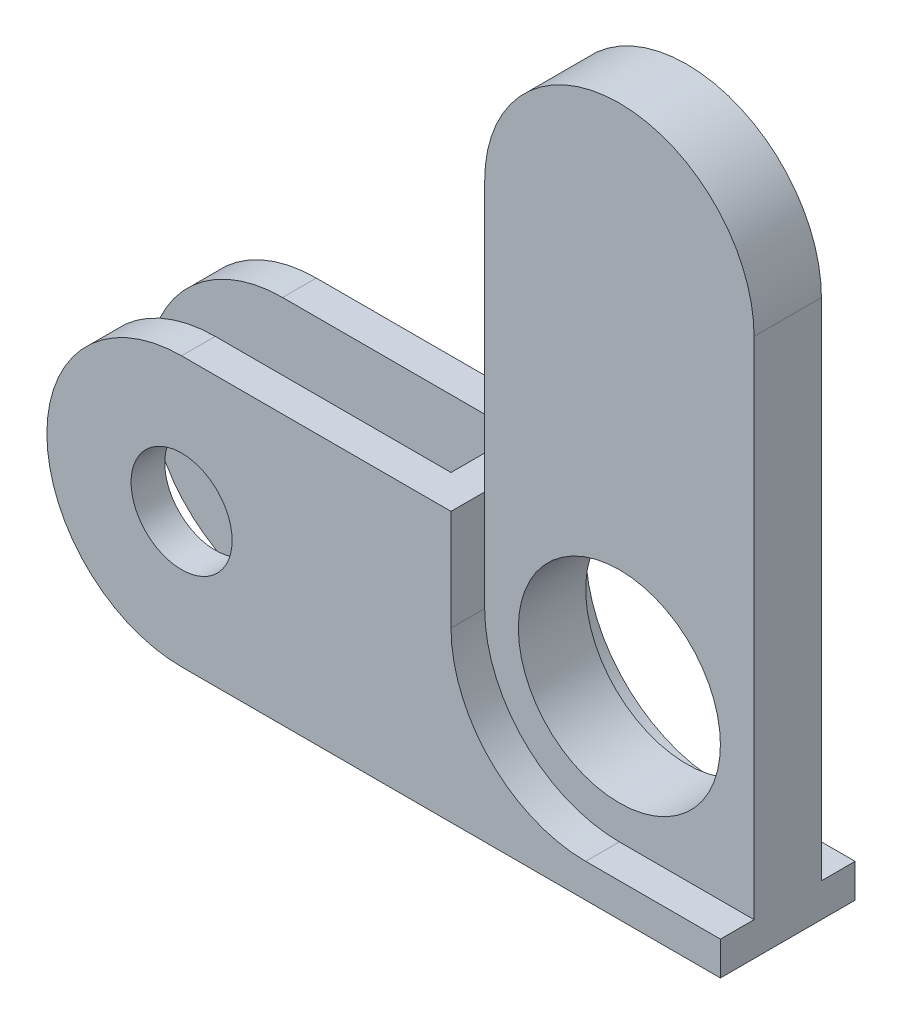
ISO-10303-21;
HEADER;
FILE_DESCRIPTION(('STEP AP214'),'2;1');
FILE_NAME('part.step','',(''),(''),'','','');
FILE_SCHEMA(('AUTOMOTIVE_DESIGN { 1 0 10303 214 1 1 1 1 }'));
ENDSEC;
DATA;
#1=APPLICATION_CONTEXT('core data for automotive mechanical design processes');
#2=APPLICATION_PROTOCOL_DEFINITION('international standard','automotive_design',2000,#1);
#3=PRODUCT_CONTEXT('',#1,'mechanical');
#4=PRODUCT('Part','Part','',(#3));
#5=PRODUCT_RELATED_PRODUCT_CATEGORY('part','',(#4));
#6=PRODUCT_DEFINITION_FORMATION('','',#4);
#7=PRODUCT_DEFINITION_CONTEXT('part definition',#1,'design');
#8=PRODUCT_DEFINITION('design','',#6,#7);
#9=PRODUCT_DEFINITION_SHAPE('','',#8);
#10=(LENGTH_UNIT() NAMED_UNIT(*) SI_UNIT(.MILLI.,.METRE.));
#11=(NAMED_UNIT(*) PLANE_ANGLE_UNIT() SI_UNIT($,.RADIAN.));
#12=(NAMED_UNIT(*) SI_UNIT($,.STERADIAN.) SOLID_ANGLE_UNIT());
#13=UNCERTAINTY_MEASURE_WITH_UNIT(LENGTH_MEASURE(1.E-05),#10,'distance_accuracy_value','');
#14=(GEOMETRIC_REPRESENTATION_CONTEXT(3) GLOBAL_UNCERTAINTY_ASSIGNED_CONTEXT((#13)) GLOBAL_UNIT_ASSIGNED_CONTEXT((#10,
#11,#12)) REPRESENTATION_CONTEXT('',''));
#15=CARTESIAN_POINT('',(0.,0.,0.));
#16=DIRECTION('',(0.,0.,1.));
#17=DIRECTION('',(1.,0.,0.));
#18=AXIS2_PLACEMENT_3D('',#15,#16,#17);
#19=CARTESIAN_POINT('',(-80.,20.,-10.));
#20=DIRECTION('',(0.,0.,1.));
#21=DIRECTION('',(1.,0.,0.));
#22=AXIS2_PLACEMENT_3D('',#19,#20,#21);
#23=CYLINDRICAL_SURFACE('',#22,20.);
#24=CARTESIAN_POINT('',(-80.,20.,-4.99999999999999));
#25=DIRECTION('',(0.,0.,-1.));
#26=DIRECTION('',(-1.,0.,0.));
#27=AXIS2_PLACEMENT_3D('',#24,#25,#26);
#28=CIRCLE('',#27,20.);
#29=CARTESIAN_POINT('',(-80.,40.,-4.99999999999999));
#30=VERTEX_POINT('',#29);
#31=CARTESIAN_POINT('',(-80.,0.,-4.99999999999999));
#32=VERTEX_POINT('',#31);
#33=EDGE_CURVE('E189',#30,#32,#28,.F.);
#34=ORIENTED_EDGE('',*,*,#33,.F.);
#35=DIRECTION('',(0.,0.,1.));
#36=VECTOR('',#35,1.);
#37=CARTESIAN_POINT('',(-80.,40.,-10.));
#38=LINE('',#37,#36);
#39=CARTESIAN_POINT('',(-80.,40.,-10.));
#40=VERTEX_POINT('',#39);
#41=EDGE_CURVE('E257',#40,#30,#38,.T.);
#42=ORIENTED_EDGE('',*,*,#41,.F.);
#43=CARTESIAN_POINT('',(-80.,20.,-10.));
#44=DIRECTION('',(0.,0.,-1.));
#45=DIRECTION('',(-1.,0.,0.));
#46=AXIS2_PLACEMENT_3D('',#43,#44,#45);
#47=CIRCLE('',#46,20.);
#48=CARTESIAN_POINT('',(-80.,0.,-10.));
#49=VERTEX_POINT('',#48);
#50=EDGE_CURVE('E262',#49,#40,#47,.T.);
#51=ORIENTED_EDGE('',*,*,#50,.F.);
#52=DIRECTION('',(0.,0.,1.));
#53=VECTOR('',#52,1.);
#54=CARTESIAN_POINT('',(-80.,0.,10.));
#55=LINE('',#54,#53);
#56=EDGE_CURVE('E260',#32,#49,#55,.F.);
#57=ORIENTED_EDGE('',*,*,#56,.F.);
#58=EDGE_LOOP('',(#34,#42,#51,#57));
#59=FACE_BOUND('',#58,.T.);
#60=ADVANCED_FACE('F31',(#59),#23,.T.);
#61=CARTESIAN_POINT('',(-80.,20.,-10.));
#62=DIRECTION('',(0.,0.,1.));
#63=DIRECTION('',(1.,0.,0.));
#64=AXIS2_PLACEMENT_3D('',#61,#62,#63);
#65=CYLINDRICAL_SURFACE('',#64,7.5);
#66=CARTESIAN_POINT('',(-80.,20.,-4.99999999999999));
#67=DIRECTION('',(0.,0.,-1.));
#68=DIRECTION('',(-1.,0.,0.));
#69=AXIS2_PLACEMENT_3D('',#66,#67,#68);
#70=CIRCLE('',#69,7.5);
#71=CARTESIAN_POINT('',(-87.5,20.,-4.99999999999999));
#72=VERTEX_POINT('',#71);
#73=EDGE_CURVE('E186',#72,#72,#70,.F.);
#74=ORIENTED_EDGE('',*,*,#73,.T.);
#75=EDGE_LOOP('',(#74));
#76=FACE_BOUND('',#75,.T.);
#77=CARTESIAN_POINT('',(-80.,20.,-10.));
#78=DIRECTION('',(0.,0.,1.));
#79=DIRECTION('',(1.,0.,0.));
#80=AXIS2_PLACEMENT_3D('',#77,#78,#79);
#81=CIRCLE('',#80,7.5);
#82=CARTESIAN_POINT('',(-72.5,20.,-10.));
#83=VERTEX_POINT('',#82);
#84=EDGE_CURVE('E238',#83,#83,#81,.T.);
#85=ORIENTED_EDGE('',*,*,#84,.F.);
#86=EDGE_LOOP('',(#85));
#87=FACE_BOUND('',#86,.T.);
#88=ADVANCED_FACE('F362',(#76,#87),#65,.F.);
#89=CARTESIAN_POINT('',(-20.,80.,-5.));
#90=DIRECTION('',(0.,0.,-1.));
#91=DIRECTION('',(-1.,0.,0.));
#92=AXIS2_PLACEMENT_3D('',#89,#90,#91);
#93=CYLINDRICAL_SURFACE('',#92,20.);
#94=DIRECTION('',(0.,0.,-1.));
#95=VECTOR('',#94,1.);
#96=CARTESIAN_POINT('',(0.,80.,10.));
#97=LINE('',#96,#95);
#98=CARTESIAN_POINT('',(0.,80.,-5.));
#99=VERTEX_POINT('',#98);
#100=CARTESIAN_POINT('',(0.,80.,5.));
#101=VERTEX_POINT('',#100);
#102=EDGE_CURVE('E266',#99,#101,#97,.F.);
#103=ORIENTED_EDGE('',*,*,#102,.F.);
#104=CARTESIAN_POINT('',(-20.,80.,-5.));
#105=DIRECTION('',(0.,0.,1.));
#106=DIRECTION('',(1.,0.,0.));
#107=AXIS2_PLACEMENT_3D('',#104,#105,#106);
#108=CIRCLE('',#107,20.);
#109=CARTESIAN_POINT('',(-40.,80.,-5.));
#110=VERTEX_POINT('',#109);
#111=EDGE_CURVE('E272',#110,#99,#108,.F.);
#112=ORIENTED_EDGE('',*,*,#111,.F.);
#113=DIRECTION('',(0.,0.,-1.));
#114=VECTOR('',#113,1.);
#115=CARTESIAN_POINT('',(-40.,80.,-10.));
#116=LINE('',#115,#114);
#117=CARTESIAN_POINT('',(-40.,80.,5.));
#118=VERTEX_POINT('',#117);
#119=EDGE_CURVE('E269',#118,#110,#116,.T.);
#120=ORIENTED_EDGE('',*,*,#119,.F.);
#121=CARTESIAN_POINT('',(-20.,80.,5.));
#122=DIRECTION('',(0.,0.,-1.));
#123=DIRECTION('',(-1.,0.,0.));
#124=AXIS2_PLACEMENT_3D('',#121,#122,#123);
#125=CIRCLE('',#124,20.);
#126=EDGE_CURVE('E274',#101,#118,#125,.F.);
#127=ORIENTED_EDGE('',*,*,#126,.F.);
#128=EDGE_LOOP('',(#103,#112,#120,#127));
#129=FACE_BOUND('',#128,.T.);
#130=ADVANCED_FACE('F317',(#129),#93,.T.);
#131=CARTESIAN_POINT('',(-80.,20.,5.00000000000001));
#132=DIRECTION('',(0.,0.,1.));
#133=DIRECTION('',(1.,0.,0.));
#134=AXIS2_PLACEMENT_3D('',#131,#132,#133);
#135=CIRCLE('',#134,20.);
#136=CARTESIAN_POINT('',(-80.,0.,5.00000000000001));
#137=VERTEX_POINT('',#136);
#138=CARTESIAN_POINT('',(-80.,40.,5.00000000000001));
#139=VERTEX_POINT('',#138);
#140=EDGE_CURVE('E46',#137,#139,#135,.F.);
#141=ORIENTED_EDGE('',*,*,#140,.F.);
#142=CARTESIAN_POINT('',(-80.,0.,10.));
#143=VERTEX_POINT('',#142);
#144=EDGE_CURVE('E172',#143,#137,#55,.F.);
#145=ORIENTED_EDGE('',*,*,#144,.F.);
#146=CARTESIAN_POINT('',(-80.,20.,10.));
#147=DIRECTION('',(0.,0.,-1.));
#148=DIRECTION('',(-1.,0.,0.));
#149=AXIS2_PLACEMENT_3D('',#146,#147,#148);
#150=CIRCLE('',#149,20.);
#151=CARTESIAN_POINT('',(-80.,40.,10.));
#152=VERTEX_POINT('',#151);
#153=EDGE_CURVE('E264',#152,#143,#150,.F.);
#154=ORIENTED_EDGE('',*,*,#153,.F.);
#155=EDGE_CURVE('E256',#139,#152,#38,.T.);
#156=ORIENTED_EDGE('',*,*,#155,.F.);
#157=EDGE_LOOP('',(#141,#145,#154,#156));
#158=FACE_BOUND('',#157,.T.);
#159=ADVANCED_FACE('F329',(#158),#23,.T.);
#160=CARTESIAN_POINT('',(0.,0.,10.));
#161=DIRECTION('',(-1.,0.,0.));
#162=DIRECTION('',(0.,0.,1.));
#163=AXIS2_PLACEMENT_3D('',#160,#161,#162);
#164=PLANE('',#163);
#165=DIRECTION('',(0.,1.,0.));
#166=VECTOR('',#165,1.);
#167=CARTESIAN_POINT('',(0.,100.,-5.));
#168=LINE('',#167,#166);
#169=CARTESIAN_POINT('',(0.,5.,-5.));
#170=VERTEX_POINT('',#169);
#171=EDGE_CURVE('E192',#170,#99,#168,.T.);
#172=ORIENTED_EDGE('',*,*,#171,.T.);
#173=ORIENTED_EDGE('',*,*,#102,.T.);
#174=DIRECTION('',(0.,1.,0.));
#175=VECTOR('',#174,1.);
#176=CARTESIAN_POINT('',(0.,100.,5.));
#177=LINE('',#176,#175);
#178=CARTESIAN_POINT('',(0.,5.,5.));
#179=VERTEX_POINT('',#178);
#180=EDGE_CURVE('E211',#179,#101,#177,.T.);
#181=ORIENTED_EDGE('',*,*,#180,.F.);
#182=DIRECTION('',(0.,0.,1.));
#183=VECTOR('',#182,1.);
#184=CARTESIAN_POINT('',(0.,5.,5.));
#185=LINE('',#184,#183);
#186=CARTESIAN_POINT('',(0.,5.,10.));
#187=VERTEX_POINT('',#186);
#188=EDGE_CURVE('E220',#179,#187,#185,.T.);
#189=ORIENTED_EDGE('',*,*,#188,.T.);
#190=DIRECTION('',(0.,1.,0.));
#191=VECTOR('',#190,1.);
#192=CARTESIAN_POINT('',(0.,0.,10.));
#193=LINE('',#192,#191);
#194=CARTESIAN_POINT('',(0.,0.,10.));
#195=VERTEX_POINT('',#194);
#196=EDGE_CURVE('E246',#195,#187,#193,.T.);
#197=ORIENTED_EDGE('',*,*,#196,.F.);
#198=DIRECTION('',(0.,0.,-1.));
#199=VECTOR('',#198,1.);
#200=CARTESIAN_POINT('',(0.,0.,10.));
#201=LINE('',#200,#199);
#202=CARTESIAN_POINT('',(0.,0.,-10.));
#203=VERTEX_POINT('',#202);
#204=EDGE_CURVE('E250',#195,#203,#201,.T.);
#205=ORIENTED_EDGE('',*,*,#204,.T.);
#206=DIRECTION('',(0.,1.,0.));
#207=VECTOR('',#206,1.);
#208=CARTESIAN_POINT('',(0.,0.,-10.));
#209=LINE('',#208,#207);
#210=CARTESIAN_POINT('',(0.,5.,-10.));
#211=VERTEX_POINT('',#210);
#212=EDGE_CURVE('E247',#203,#211,#209,.T.);
#213=ORIENTED_EDGE('',*,*,#212,.T.);
#214=DIRECTION('',(0.,0.,-1.));
#215=VECTOR('',#214,1.);
#216=CARTESIAN_POINT('',(0.,5.,-5.));
#217=LINE('',#216,#215);
#218=EDGE_CURVE('E201',#170,#211,#217,.T.);
#219=ORIENTED_EDGE('',*,*,#218,.F.);
#220=EDGE_LOOP('',(#172,#173,#181,#189,#197,#205,#213,#219));
#221=FACE_BOUND('',#220,.T.);
#222=ADVANCED_FACE('F311',(#221),#164,.F.);
#223=CARTESIAN_POINT('',(-100.,100.,-10.));
#224=DIRECTION('',(0.,0.,-1.));
#225=DIRECTION('',(-1.,0.,0.));
#226=AXIS2_PLACEMENT_3D('',#223,#224,#225);
#227=PLANE('',#226);
#228=ORIENTED_EDGE('',*,*,#84,.T.);
#229=EDGE_LOOP('',(#228));
#230=FACE_BOUND('',#229,.T.);
#231=DIRECTION('',(1.,0.,0.));
#232=VECTOR('',#231,1.);
#233=CARTESIAN_POINT('',(-100.,0.,-10.));
#234=LINE('',#233,#232);
#235=EDGE_CURVE('E241',#49,#203,#234,.T.);
#236=ORIENTED_EDGE('',*,*,#235,.F.);
#237=ORIENTED_EDGE('',*,*,#50,.T.);
#238=DIRECTION('',(1.,0.,0.));
#239=VECTOR('',#238,1.);
#240=CARTESIAN_POINT('',(-100.,40.,-10.));
#241=LINE('',#240,#239);
#242=CARTESIAN_POINT('',(-40.,40.,-10.));
#243=VERTEX_POINT('',#242);
#244=EDGE_CURVE('E229',#40,#243,#241,.T.);
#245=ORIENTED_EDGE('',*,*,#244,.T.);
#246=DIRECTION('',(0.,-1.,0.));
#247=VECTOR('',#246,1.);
#248=CARTESIAN_POINT('',(-40.,100.,-10.));
#249=LINE('',#248,#247);
#250=CARTESIAN_POINT('',(-40.,25.,-10.));
#251=VERTEX_POINT('',#250);
#252=EDGE_CURVE('E196',#243,#251,#249,.T.);
#253=ORIENTED_EDGE('',*,*,#252,.T.);
#254=CARTESIAN_POINT('',(-20.,25.,-10.));
#255=DIRECTION('',(0.,0.,-1.));
#256=DIRECTION('',(-1.,0.,0.));
#257=AXIS2_PLACEMENT_3D('',#254,#255,#256);
#258=CIRCLE('',#257,20.);
#259=CARTESIAN_POINT('',(-20.,5.,-10.));
#260=VERTEX_POINT('',#259);
#261=EDGE_CURVE('E289',#251,#260,#258,.F.);
#262=ORIENTED_EDGE('',*,*,#261,.T.);
#263=DIRECTION('',(1.,0.,0.));
#264=VECTOR('',#263,1.);
#265=CARTESIAN_POINT('',(0.,5.,-10.));
#266=LINE('',#265,#264);
#267=EDGE_CURVE('E191',#260,#211,#266,.T.);
#268=ORIENTED_EDGE('',*,*,#267,.T.);
#269=ORIENTED_EDGE('',*,*,#212,.F.);
#270=EDGE_LOOP('',(#236,#237,#245,#253,#262,#268,#269));
#271=FACE_BOUND('',#270,.T.);
#272=ADVANCED_FACE('F334',(#230,#271),#227,.T.);
#273=CARTESIAN_POINT('',(-100.,0.,10.));
#274=DIRECTION('',(0.,1.,0.));
#275=DIRECTION('',(0.,0.,1.));
#276=AXIS2_PLACEMENT_3D('',#273,#274,#275);
#277=PLANE('',#276);
#278=DIRECTION('',(0.,0.,-1.));
#279=VECTOR('',#278,1.);
#280=CARTESIAN_POINT('',(-45.,0.,-5.));
#281=LINE('',#280,#279);
#282=CARTESIAN_POINT('',(-45.,0.,5.00000000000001));
#283=VERTEX_POINT('',#282);
#284=CARTESIAN_POINT('',(-45.,0.,-5.));
#285=VERTEX_POINT('',#284);
#286=EDGE_CURVE('E162',#283,#285,#281,.T.);
#287=ORIENTED_EDGE('',*,*,#286,.T.);
#288=DIRECTION('',(-1.,0.,0.));
#289=VECTOR('',#288,1.);
#290=CARTESIAN_POINT('',(-100.,0.,-4.99999999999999));
#291=LINE('',#290,#289);
#292=EDGE_CURVE('E159',#285,#32,#291,.T.);
#293=ORIENTED_EDGE('',*,*,#292,.T.);
#294=ORIENTED_EDGE('',*,*,#56,.T.);
#295=ORIENTED_EDGE('',*,*,#235,.T.);
#296=ORIENTED_EDGE('',*,*,#204,.F.);
#297=DIRECTION('',(1.,0.,0.));
#298=VECTOR('',#297,1.);
#299=CARTESIAN_POINT('',(-100.,0.,10.));
#300=LINE('',#299,#298);
#301=EDGE_CURVE('E244',#143,#195,#300,.T.);
#302=ORIENTED_EDGE('',*,*,#301,.F.);
#303=ORIENTED_EDGE('',*,*,#144,.T.);
#304=DIRECTION('',(1.,0.,0.));
#305=VECTOR('',#304,1.);
#306=CARTESIAN_POINT('',(-100.,0.,5.00000000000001));
#307=LINE('',#306,#305);
#308=EDGE_CURVE('E154',#137,#283,#307,.T.);
#309=ORIENTED_EDGE('',*,*,#308,.T.);
#310=EDGE_LOOP('',(#287,#293,#294,#295,#296,#302,#303,#309));
#311=FACE_BOUND('',#310,.T.);
#312=ADVANCED_FACE('F169',(#311),#277,.F.);
#313=CARTESIAN_POINT('',(-100.,100.,10.));
#314=DIRECTION('',(0.,0.,-1.));
#315=DIRECTION('',(-1.,0.,0.));
#316=AXIS2_PLACEMENT_3D('',#313,#314,#315);
#317=PLANE('',#316);
#318=CARTESIAN_POINT('',(-80.,20.,10.));
#319=DIRECTION('',(0.,0.,1.));
#320=DIRECTION('',(1.,0.,0.));
#321=AXIS2_PLACEMENT_3D('',#318,#319,#320);
#322=CIRCLE('',#321,7.5);
#323=CARTESIAN_POINT('',(-72.5,20.,10.));
#324=VERTEX_POINT('',#323);
#325=EDGE_CURVE('E236',#324,#324,#322,.T.);
#326=ORIENTED_EDGE('',*,*,#325,.F.);
#327=EDGE_LOOP('',(#326));
#328=FACE_BOUND('',#327,.T.);
#329=DIRECTION('',(1.,0.,0.));
#330=VECTOR('',#329,1.);
#331=CARTESIAN_POINT('',(-100.,40.,10.));
#332=LINE('',#331,#330);
#333=CARTESIAN_POINT('',(-40.,40.,10.));
#334=VERTEX_POINT('',#333);
#335=EDGE_CURVE('E228',#152,#334,#332,.T.);
#336=ORIENTED_EDGE('',*,*,#335,.F.);
#337=ORIENTED_EDGE('',*,*,#153,.T.);
#338=ORIENTED_EDGE('',*,*,#301,.T.);
#339=ORIENTED_EDGE('',*,*,#196,.T.);
#340=DIRECTION('',(1.,0.,0.));
#341=VECTOR('',#340,1.);
#342=CARTESIAN_POINT('',(0.,5.,10.));
#343=LINE('',#342,#341);
#344=CARTESIAN_POINT('',(-20.,5.,10.));
#345=VERTEX_POINT('',#344);
#346=EDGE_CURVE('E215',#345,#187,#343,.T.);
#347=ORIENTED_EDGE('',*,*,#346,.F.);
#348=CARTESIAN_POINT('',(-20.,25.,10.));
#349=DIRECTION('',(0.,0.,-1.));
#350=DIRECTION('',(-1.,0.,0.));
#351=AXIS2_PLACEMENT_3D('',#348,#349,#350);
#352=CIRCLE('',#351,20.);
#353=CARTESIAN_POINT('',(-40.,25.,10.));
#354=VERTEX_POINT('',#353);
#355=EDGE_CURVE('E39',#345,#354,#352,.T.);
#356=ORIENTED_EDGE('',*,*,#355,.T.);
#357=DIRECTION('',(0.,-1.,0.));
#358=VECTOR('',#357,1.);
#359=CARTESIAN_POINT('',(-40.,100.,10.));
#360=LINE('',#359,#358);
#361=EDGE_CURVE('E210',#334,#354,#360,.T.);
#362=ORIENTED_EDGE('',*,*,#361,.F.);
#363=EDGE_LOOP('',(#336,#337,#338,#339,#347,#356,#362));
#364=FACE_BOUND('',#363,.T.);
#365=ADVANCED_FACE('F294',(#328,#364),#317,.F.);
#366=CARTESIAN_POINT('',(-80.,20.,5.00000000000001));
#367=DIRECTION('',(0.,0.,1.));
#368=DIRECTION('',(1.,0.,0.));
#369=AXIS2_PLACEMENT_3D('',#366,#367,#368);
#370=CIRCLE('',#369,7.5);
#371=CARTESIAN_POINT('',(-72.5,20.,5.00000000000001));
#372=VERTEX_POINT('',#371);
#373=EDGE_CURVE('E181',#372,#372,#370,.F.);
#374=ORIENTED_EDGE('',*,*,#373,.T.);
#375=EDGE_LOOP('',(#374));
#376=FACE_BOUND('',#375,.T.);
#377=ORIENTED_EDGE('',*,*,#325,.T.);
#378=EDGE_LOOP('',(#377));
#379=FACE_BOUND('',#378,.T.);
#380=ADVANCED_FACE('F370',(#376,#379),#65,.F.);
#381=CARTESIAN_POINT('',(-20.,25.,-10.));
#382=DIRECTION('',(0.,0.,1.));
#383=DIRECTION('',(1.,0.,0.));
#384=AXIS2_PLACEMENT_3D('',#381,#382,#383);
#385=CYLINDRICAL_SURFACE('',#384,15.);
#386=CARTESIAN_POINT('',(-20.,25.,-5.));
#387=DIRECTION('',(0.,0.,1.));
#388=DIRECTION('',(1.,0.,0.));
#389=AXIS2_PLACEMENT_3D('',#386,#387,#388);
#390=CIRCLE('',#389,15.);
#391=CARTESIAN_POINT('',(-5.00000000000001,25.,-5.));
#392=VERTEX_POINT('',#391);
#393=EDGE_CURVE('E207',#392,#392,#390,.F.);
#394=ORIENTED_EDGE('',*,*,#393,.T.);
#395=EDGE_LOOP('',(#394));
#396=FACE_BOUND('',#395,.T.);
#397=CARTESIAN_POINT('',(-20.,25.,5.));
#398=DIRECTION('',(0.,0.,-1.));
#399=DIRECTION('',(-1.,0.,0.));
#400=AXIS2_PLACEMENT_3D('',#397,#398,#399);
#401=CIRCLE('',#400,15.);
#402=CARTESIAN_POINT('',(-35.,25.,5.));
#403=VERTEX_POINT('',#402);
#404=EDGE_CURVE('E225',#403,#403,#401,.F.);
#405=ORIENTED_EDGE('',*,*,#404,.T.);
#406=EDGE_LOOP('',(#405));
#407=FACE_BOUND('',#406,.T.);
#408=ADVANCED_FACE('F414',(#396,#407),#385,.F.);
#409=CARTESIAN_POINT('',(-40.,100.,-10.));
#410=DIRECTION('',(1.,0.,0.));
#411=DIRECTION('',(0.,0.,-1.));
#412=AXIS2_PLACEMENT_3D('',#409,#410,#411);
#413=PLANE('',#412);
#414=DIRECTION('',(0.,-1.,0.));
#415=VECTOR('',#414,1.);
#416=CARTESIAN_POINT('',(-40.,100.,5.));
#417=LINE('',#416,#415);
#418=CARTESIAN_POINT('',(-40.,40.,5.));
#419=VERTEX_POINT('',#418);
#420=EDGE_CURVE('E216',#118,#419,#417,.T.);
#421=ORIENTED_EDGE('',*,*,#420,.F.);
#422=ORIENTED_EDGE('',*,*,#119,.T.);
#423=DIRECTION('',(0.,-1.,0.));
#424=VECTOR('',#423,1.);
#425=CARTESIAN_POINT('',(-40.,100.,-5.));
#426=LINE('',#425,#424);
#427=CARTESIAN_POINT('',(-40.,40.,-5.));
#428=VERTEX_POINT('',#427);
#429=EDGE_CURVE('E199',#110,#428,#426,.T.);
#430=ORIENTED_EDGE('',*,*,#429,.T.);
#431=DIRECTION('',(0.,0.,1.));
#432=VECTOR('',#431,1.);
#433=CARTESIAN_POINT('',(-40.,40.,-10.));
#434=LINE('',#433,#432);
#435=EDGE_CURVE('E237',#428,#419,#434,.T.);
#436=ORIENTED_EDGE('',*,*,#435,.T.);
#437=EDGE_LOOP('',(#421,#422,#430,#436));
#438=FACE_BOUND('',#437,.T.);
#439=ADVANCED_FACE('F320',(#438),#413,.F.);
#440=CARTESIAN_POINT('',(-100.,40.,-10.));
#441=DIRECTION('',(0.,-1.,0.));
#442=DIRECTION('',(0.,0.,-1.));
#443=AXIS2_PLACEMENT_3D('',#440,#441,#442);
#444=PLANE('',#443);
#445=ORIENTED_EDGE('',*,*,#41,.T.);
#446=DIRECTION('',(-1.,0.,0.));
#447=VECTOR('',#446,1.);
#448=CARTESIAN_POINT('',(-100.,40.,-4.99999999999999));
#449=LINE('',#448,#447);
#450=CARTESIAN_POINT('',(-45.,40.,-5.));
#451=VERTEX_POINT('',#450);
#452=EDGE_CURVE('E173',#451,#30,#449,.T.);
#453=ORIENTED_EDGE('',*,*,#452,.F.);
#454=DIRECTION('',(0.,0.,-1.));
#455=VECTOR('',#454,1.);
#456=CARTESIAN_POINT('',(-45.,40.,-5.));
#457=LINE('',#456,#455);
#458=CARTESIAN_POINT('',(-45.,40.,5.00000000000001));
#459=VERTEX_POINT('',#458);
#460=EDGE_CURVE('E176',#459,#451,#457,.T.);
#461=ORIENTED_EDGE('',*,*,#460,.F.);
#462=DIRECTION('',(-1.,0.,0.));
#463=VECTOR('',#462,1.);
#464=CARTESIAN_POINT('',(-100.,40.,5.00000000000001));
#465=LINE('',#464,#463);
#466=EDGE_CURVE('E11',#459,#139,#465,.T.);
#467=ORIENTED_EDGE('',*,*,#466,.T.);
#468=ORIENTED_EDGE('',*,*,#155,.T.);
#469=ORIENTED_EDGE('',*,*,#335,.T.);
#470=EDGE_CURVE('E231',#419,#334,#434,.T.);
#471=ORIENTED_EDGE('',*,*,#470,.F.);
#472=ORIENTED_EDGE('',*,*,#435,.F.);
#473=EDGE_CURVE('E233',#243,#428,#434,.T.);
#474=ORIENTED_EDGE('',*,*,#473,.F.);
#475=ORIENTED_EDGE('',*,*,#244,.F.);
#476=EDGE_LOOP('',(#445,#453,#461,#467,#468,#469,#471,#472,#474,#475));
#477=FACE_BOUND('',#476,.T.);
#478=ADVANCED_FACE('F324',(#477),#444,.F.);
#479=CARTESIAN_POINT('',(0.,100.,5.));
#480=DIRECTION('',(0.,0.,-1.));
#481=DIRECTION('',(-1.,0.,0.));
#482=AXIS2_PLACEMENT_3D('',#479,#480,#481);
#483=PLANE('',#482);
#484=CARTESIAN_POINT('',(-40.,25.,5.));
#485=VERTEX_POINT('',#484);
#486=EDGE_CURVE('E214',#419,#485,#417,.T.);
#487=ORIENTED_EDGE('',*,*,#486,.T.);
#488=CARTESIAN_POINT('',(-20.,25.,5.));
#489=DIRECTION('',(0.,0.,-1.));
#490=DIRECTION('',(-1.,0.,0.));
#491=AXIS2_PLACEMENT_3D('',#488,#489,#490);
#492=CIRCLE('',#491,20.);
#493=CARTESIAN_POINT('',(-20.,5.,5.));
#494=VERTEX_POINT('',#493);
#495=EDGE_CURVE('E287',#485,#494,#492,.F.);
#496=ORIENTED_EDGE('',*,*,#495,.T.);
#497=DIRECTION('',(1.,0.,0.));
#498=VECTOR('',#497,1.);
#499=CARTESIAN_POINT('',(0.,5.,5.));
#500=LINE('',#499,#498);
#501=EDGE_CURVE('E218',#494,#179,#500,.T.);
#502=ORIENTED_EDGE('',*,*,#501,.T.);
#503=ORIENTED_EDGE('',*,*,#180,.T.);
#504=ORIENTED_EDGE('',*,*,#126,.T.);
#505=ORIENTED_EDGE('',*,*,#420,.T.);
#506=EDGE_LOOP('',(#487,#496,#502,#503,#504,#505));
#507=FACE_BOUND('',#506,.T.);
#508=ORIENTED_EDGE('',*,*,#404,.F.);
#509=EDGE_LOOP('',(#508));
#510=FACE_BOUND('',#509,.T.);
#511=ADVANCED_FACE('F303',(#507,#510),#483,.F.);
#512=CARTESIAN_POINT('',(-40.,100.,5.));
#513=DIRECTION('',(-1.,0.,0.));
#514=DIRECTION('',(0.,-1.,0.));
#515=AXIS2_PLACEMENT_3D('',#512,#513,#514);
#516=PLANE('',#515);
#517=ORIENTED_EDGE('',*,*,#361,.T.);
#518=DIRECTION('',(0.,0.,1.));
#519=VECTOR('',#518,1.);
#520=CARTESIAN_POINT('',(-40.,25.,5.));
#521=LINE('',#520,#519);
#522=EDGE_CURVE('E53',#354,#485,#521,.F.);
#523=ORIENTED_EDGE('',*,*,#522,.T.);
#524=ORIENTED_EDGE('',*,*,#486,.F.);
#525=ORIENTED_EDGE('',*,*,#470,.T.);
#526=EDGE_LOOP('',(#517,#523,#524,#525));
#527=FACE_BOUND('',#526,.T.);
#528=ADVANCED_FACE('F298',(#527),#516,.F.);
#529=CARTESIAN_POINT('',(0.,5.,5.));
#530=DIRECTION('',(0.,-1.,0.));
#531=DIRECTION('',(1.,0.,0.));
#532=AXIS2_PLACEMENT_3D('',#529,#530,#531);
#533=PLANE('',#532);
#534=ORIENTED_EDGE('',*,*,#501,.F.);
#535=DIRECTION('',(0.,0.,1.));
#536=VECTOR('',#535,1.);
#537=CARTESIAN_POINT('',(-20.,5.,10.));
#538=LINE('',#537,#536);
#539=EDGE_CURVE('E283',#494,#345,#538,.T.);
#540=ORIENTED_EDGE('',*,*,#539,.T.);
#541=ORIENTED_EDGE('',*,*,#346,.T.);
#542=ORIENTED_EDGE('',*,*,#188,.F.);
#543=EDGE_LOOP('',(#534,#540,#541,#542));
#544=FACE_BOUND('',#543,.T.);
#545=ADVANCED_FACE('F307',(#544),#533,.F.);
#546=CARTESIAN_POINT('',(0.,100.,-5.));
#547=DIRECTION('',(0.,0.,1.));
#548=DIRECTION('',(-1.,0.,0.));
#549=AXIS2_PLACEMENT_3D('',#546,#547,#548);
#550=PLANE('',#549);
#551=DIRECTION('',(1.,0.,0.));
#552=VECTOR('',#551,1.);
#553=CARTESIAN_POINT('',(0.,5.,-5.));
#554=LINE('',#553,#552);
#555=CARTESIAN_POINT('',(-20.,5.,-5.));
#556=VERTEX_POINT('',#555);
#557=EDGE_CURVE('E195',#556,#170,#554,.T.);
#558=ORIENTED_EDGE('',*,*,#557,.F.);
#559=CARTESIAN_POINT('',(-20.,25.,-5.));
#560=DIRECTION('',(0.,0.,1.));
#561=DIRECTION('',(1.,0.,0.));
#562=AXIS2_PLACEMENT_3D('',#559,#560,#561);
#563=CIRCLE('',#562,20.);
#564=CARTESIAN_POINT('',(-40.,25.,-5.));
#565=VERTEX_POINT('',#564);
#566=EDGE_CURVE('E281',#556,#565,#563,.F.);
#567=ORIENTED_EDGE('',*,*,#566,.T.);
#568=EDGE_CURVE('E198',#428,#565,#426,.T.);
#569=ORIENTED_EDGE('',*,*,#568,.F.);
#570=ORIENTED_EDGE('',*,*,#429,.F.);
#571=ORIENTED_EDGE('',*,*,#111,.T.);
#572=ORIENTED_EDGE('',*,*,#171,.F.);
#573=EDGE_LOOP('',(#558,#567,#569,#570,#571,#572));
#574=FACE_BOUND('',#573,.T.);
#575=ORIENTED_EDGE('',*,*,#393,.F.);
#576=EDGE_LOOP('',(#575));
#577=FACE_BOUND('',#576,.T.);
#578=ADVANCED_FACE('F342',(#574,#577),#550,.F.);
#579=CARTESIAN_POINT('',(-40.,100.,-5.));
#580=DIRECTION('',(1.,0.,0.));
#581=DIRECTION('',(0.,1.,0.));
#582=AXIS2_PLACEMENT_3D('',#579,#580,#581);
#583=PLANE('',#582);
#584=ORIENTED_EDGE('',*,*,#568,.T.);
#585=DIRECTION('',(0.,0.,-1.));
#586=VECTOR('',#585,1.);
#587=CARTESIAN_POINT('',(-40.,25.,-10.));
#588=LINE('',#587,#586);
#589=EDGE_CURVE('E276',#565,#251,#588,.T.);
#590=ORIENTED_EDGE('',*,*,#589,.T.);
#591=ORIENTED_EDGE('',*,*,#252,.F.);
#592=ORIENTED_EDGE('',*,*,#473,.T.);
#593=EDGE_LOOP('',(#584,#590,#591,#592));
#594=FACE_BOUND('',#593,.T.);
#595=ADVANCED_FACE('F349',(#594),#583,.T.);
#596=CARTESIAN_POINT('',(0.,5.,-5.));
#597=DIRECTION('',(0.,1.,0.));
#598=DIRECTION('',(-1.,0.,0.));
#599=AXIS2_PLACEMENT_3D('',#596,#597,#598);
#600=PLANE('',#599);
#601=ORIENTED_EDGE('',*,*,#267,.F.);
#602=DIRECTION('',(0.,0.,-1.));
#603=VECTOR('',#602,1.);
#604=CARTESIAN_POINT('',(-20.,5.,-5.));
#605=LINE('',#604,#603);
#606=EDGE_CURVE('E279',#260,#556,#605,.F.);
#607=ORIENTED_EDGE('',*,*,#606,.T.);
#608=ORIENTED_EDGE('',*,*,#557,.T.);
#609=ORIENTED_EDGE('',*,*,#218,.T.);
#610=EDGE_LOOP('',(#601,#607,#608,#609));
#611=FACE_BOUND('',#610,.T.);
#612=ADVANCED_FACE('F338',(#611),#600,.T.);
#613=CARTESIAN_POINT('',(-20.,25.,-5.));
#614=DIRECTION('',(0.,0.,1.));
#615=DIRECTION('',(1.,0.,0.));
#616=AXIS2_PLACEMENT_3D('',#613,#614,#615);
#617=CYLINDRICAL_SURFACE('',#616,20.);
#618=ORIENTED_EDGE('',*,*,#566,.F.);
#619=ORIENTED_EDGE('',*,*,#606,.F.);
#620=ORIENTED_EDGE('',*,*,#261,.F.);
#621=ORIENTED_EDGE('',*,*,#589,.F.);
#622=EDGE_LOOP('',(#618,#619,#620,#621));
#623=FACE_BOUND('',#622,.T.);
#624=ADVANCED_FACE('F352',(#623),#617,.F.);
#625=CARTESIAN_POINT('',(-20.,25.,5.));
#626=DIRECTION('',(0.,0.,-1.));
#627=DIRECTION('',(-1.,0.,0.));
#628=AXIS2_PLACEMENT_3D('',#625,#626,#627);
#629=CYLINDRICAL_SURFACE('',#628,20.);
#630=ORIENTED_EDGE('',*,*,#495,.F.);
#631=ORIENTED_EDGE('',*,*,#522,.F.);
#632=ORIENTED_EDGE('',*,*,#355,.F.);
#633=ORIENTED_EDGE('',*,*,#539,.F.);
#634=EDGE_LOOP('',(#630,#631,#632,#633));
#635=FACE_BOUND('',#634,.T.);
#636=ADVANCED_FACE('F33',(#635),#629,.F.);
#637=CARTESIAN_POINT('',(-100.,0.,-4.99999999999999));
#638=DIRECTION('',(0.,0.,-1.));
#639=DIRECTION('',(-1.,0.,0.));
#640=AXIS2_PLACEMENT_3D('',#637,#638,#639);
#641=PLANE('',#640);
#642=ORIENTED_EDGE('',*,*,#33,.T.);
#643=ORIENTED_EDGE('',*,*,#292,.F.);
#644=DIRECTION('',(0.,1.,0.));
#645=VECTOR('',#644,1.);
#646=CARTESIAN_POINT('',(-45.,0.,-5.));
#647=LINE('',#646,#645);
#648=EDGE_CURVE('E158',#285,#451,#647,.T.);
#649=ORIENTED_EDGE('',*,*,#648,.T.);
#650=ORIENTED_EDGE('',*,*,#452,.T.);
#651=EDGE_LOOP('',(#642,#643,#649,#650));
#652=FACE_BOUND('',#651,.T.);
#653=ORIENTED_EDGE('',*,*,#73,.F.);
#654=EDGE_LOOP('',(#653));
#655=FACE_BOUND('',#654,.T.);
#656=ADVANCED_FACE('F358',(#652,#655),#641,.F.);
#657=CARTESIAN_POINT('',(-100.,0.,5.00000000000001));
#658=DIRECTION('',(0.,0.,1.));
#659=DIRECTION('',(1.,0.,0.));
#660=AXIS2_PLACEMENT_3D('',#657,#658,#659);
#661=PLANE('',#660);
#662=ORIENTED_EDGE('',*,*,#140,.T.);
#663=ORIENTED_EDGE('',*,*,#466,.F.);
#664=DIRECTION('',(0.,1.,0.));
#665=VECTOR('',#664,1.);
#666=CARTESIAN_POINT('',(-45.,0.,5.00000000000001));
#667=LINE('',#666,#665);
#668=EDGE_CURVE('E149',#283,#459,#667,.T.);
#669=ORIENTED_EDGE('',*,*,#668,.F.);
#670=ORIENTED_EDGE('',*,*,#308,.F.);
#671=EDGE_LOOP('',(#662,#663,#669,#670));
#672=FACE_BOUND('',#671,.T.);
#673=ORIENTED_EDGE('',*,*,#373,.F.);
#674=EDGE_LOOP('',(#673));
#675=FACE_BOUND('',#674,.T.);
#676=ADVANCED_FACE('F151',(#672,#675),#661,.F.);
#677=CARTESIAN_POINT('',(-45.,0.,-5.));
#678=DIRECTION('',(1.,0.,0.));
#679=DIRECTION('',(0.,0.,-1.));
#680=AXIS2_PLACEMENT_3D('',#677,#678,#679);
#681=PLANE('',#680);
#682=ORIENTED_EDGE('',*,*,#460,.T.);
#683=ORIENTED_EDGE('',*,*,#648,.F.);
#684=ORIENTED_EDGE('',*,*,#286,.F.);
#685=ORIENTED_EDGE('',*,*,#668,.T.);
#686=EDGE_LOOP('',(#682,#683,#684,#685));
#687=FACE_BOUND('',#686,.T.);
#688=ADVANCED_FACE('F163',(#687),#681,.F.);
#689=CLOSED_SHELL('',(#60,#88,#130,#159,#222,#272,#312,#365,#380,#408,#439,#478,#511,#528,#545,
#578,#595,#612,#624,#636,#656,#676,#688));
#690=MANIFOLD_SOLID_BREP('B2',#689);
#691=ADVANCED_BREP_SHAPE_REPRESENTATION('',(#18,#690),#14);
#692=SHAPE_DEFINITION_REPRESENTATION(#9,#691);
ENDSEC;
END-ISO-10303-21;
